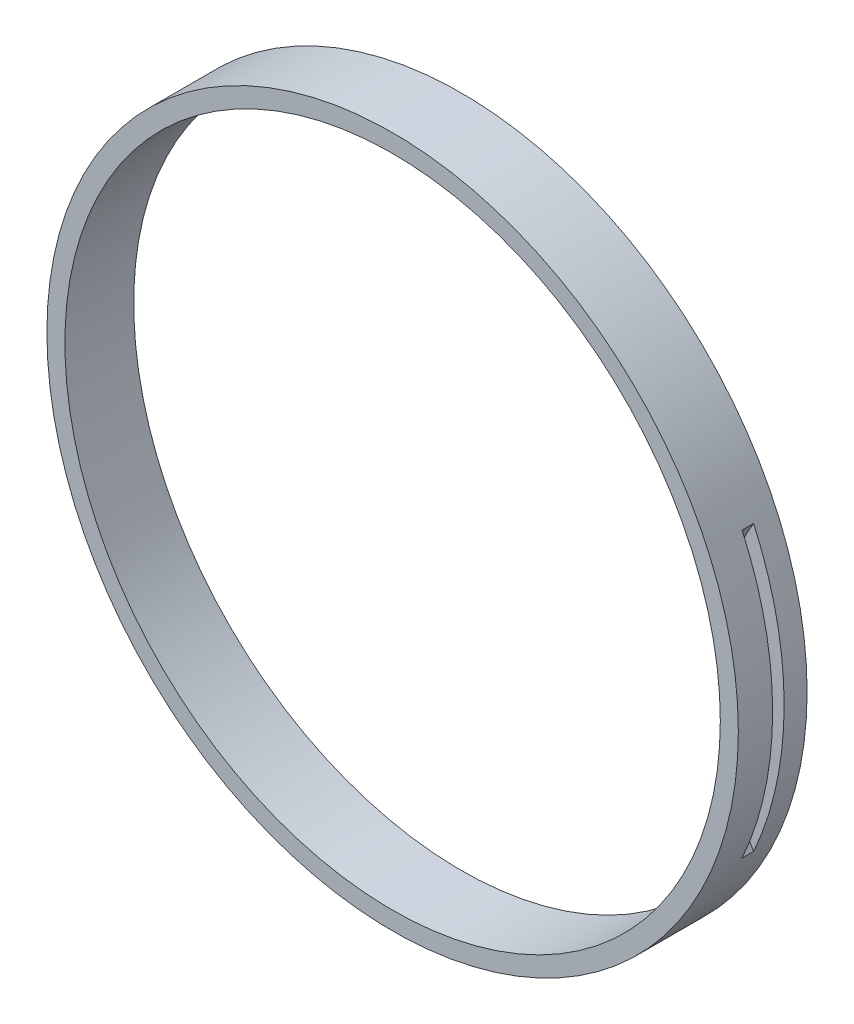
ISO-10303-21;
HEADER;
FILE_DESCRIPTION(('STEP AP214'),'2;1');
FILE_NAME('part.step','',(''),(''),'','','');
FILE_SCHEMA(('AUTOMOTIVE_DESIGN { 1 0 10303 214 1 1 1 1 }'));
ENDSEC;
DATA;
#1=APPLICATION_CONTEXT('core data for automotive mechanical design processes');
#2=APPLICATION_PROTOCOL_DEFINITION('international standard','automotive_design',2000,#1);
#3=PRODUCT_CONTEXT('',#1,'mechanical');
#4=PRODUCT('Part','Part','',(#3));
#5=PRODUCT_RELATED_PRODUCT_CATEGORY('part','',(#4));
#6=PRODUCT_DEFINITION_FORMATION('','',#4);
#7=PRODUCT_DEFINITION_CONTEXT('part definition',#1,'design');
#8=PRODUCT_DEFINITION('design','',#6,#7);
#9=PRODUCT_DEFINITION_SHAPE('','',#8);
#10=(LENGTH_UNIT() NAMED_UNIT(*) SI_UNIT(.MILLI.,.METRE.));
#11=(NAMED_UNIT(*) PLANE_ANGLE_UNIT() SI_UNIT($,.RADIAN.));
#12=(NAMED_UNIT(*) SI_UNIT($,.STERADIAN.) SOLID_ANGLE_UNIT());
#13=UNCERTAINTY_MEASURE_WITH_UNIT(LENGTH_MEASURE(1.E-05),#10,'distance_accuracy_value','');
#14=(GEOMETRIC_REPRESENTATION_CONTEXT(3) GLOBAL_UNCERTAINTY_ASSIGNED_CONTEXT((#13)) GLOBAL_UNIT_ASSIGNED_CONTEXT((#10,
#11,#12)) REPRESENTATION_CONTEXT('',''));
#15=CARTESIAN_POINT('',(0.,0.,0.));
#16=DIRECTION('',(0.,0.,1.));
#17=DIRECTION('',(1.,0.,0.));
#18=AXIS2_PLACEMENT_3D('',#15,#16,#17);
#19=CARTESIAN_POINT('',(0.,0.,4.7498));
#20=DIRECTION('',(0.,0.,-1.));
#21=DIRECTION('',(-1.,0.,0.));
#22=AXIS2_PLACEMENT_3D('',#19,#20,#21);
#23=CYLINDRICAL_SURFACE('',#22,23.876);
#24=CARTESIAN_POINT('',(0.,0.,0.));
#25=DIRECTION('',(0.,0.,1.));
#26=DIRECTION('',(1.,0.,0.));
#27=AXIS2_PLACEMENT_3D('',#24,#25,#26);
#28=CIRCLE('',#27,23.876);
#29=CARTESIAN_POINT('',(23.876,0.,0.));
#30=VERTEX_POINT('',#29);
#31=EDGE_CURVE('E102',#30,#30,#28,.T.);
#32=ORIENTED_EDGE('',*,*,#31,.T.);
#33=EDGE_LOOP('',(#32));
#34=FACE_BOUND('',#33,.T.);
#35=CARTESIAN_POINT('',(0.,0.,4.7498));
#36=DIRECTION('',(0.,0.,1.));
#37=DIRECTION('',(1.,0.,0.));
#38=AXIS2_PLACEMENT_3D('',#35,#36,#37);
#39=CIRCLE('',#38,23.876);
#40=CARTESIAN_POINT('',(23.876,0.,4.7498));
#41=VERTEX_POINT('',#40);
#42=EDGE_CURVE('E105',#41,#41,#39,.T.);
#43=ORIENTED_EDGE('',*,*,#42,.F.);
#44=EDGE_LOOP('',(#43));
#45=FACE_BOUND('',#44,.T.);
#46=CARTESIAN_POINT('',(0.,0.,2.38125));
#47=DIRECTION('',(0.,0.,-1.));
#48=DIRECTION('',(-1.,0.,0.));
#49=AXIS2_PLACEMENT_3D('',#46,#47,#48);
#50=CIRCLE('',#49,23.876);
#51=CARTESIAN_POINT('',(21.7686466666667,9.80761940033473,2.38125));
#52=VERTEX_POINT('',#51);
#53=CARTESIAN_POINT('',(21.7686466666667,-9.80761940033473,2.38125));
#54=VERTEX_POINT('',#53);
#55=EDGE_CURVE('E79',#52,#54,#50,.T.);
#56=ORIENTED_EDGE('',*,*,#55,.F.);
#57=DIRECTION('',(0.,0.,-1.));
#58=VECTOR('',#57,1.);
#59=CARTESIAN_POINT('',(21.7686466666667,9.80761940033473,1.984375));
#60=LINE('',#59,#58);
#61=CARTESIAN_POINT('',(21.7686466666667,9.80761940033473,1.5875));
#62=VERTEX_POINT('',#61);
#63=EDGE_CURVE('E85',#52,#62,#60,.T.);
#64=ORIENTED_EDGE('',*,*,#63,.T.);
#65=CARTESIAN_POINT('',(0.,0.,1.5875));
#66=DIRECTION('',(0.,0.,-1.));
#67=DIRECTION('',(-1.,0.,0.));
#68=AXIS2_PLACEMENT_3D('',#65,#66,#67);
#69=CIRCLE('',#68,23.876);
#70=CARTESIAN_POINT('',(21.7686466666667,-9.80761940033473,1.5875));
#71=VERTEX_POINT('',#70);
#72=EDGE_CURVE('E74',#62,#71,#69,.T.);
#73=ORIENTED_EDGE('',*,*,#72,.T.);
#74=DIRECTION('',(0.,0.,-1.));
#75=VECTOR('',#74,1.);
#76=CARTESIAN_POINT('',(21.7686466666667,-9.80761940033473,1.984375));
#77=LINE('',#76,#75);
#78=EDGE_CURVE('E93',#71,#54,#77,.F.);
#79=ORIENTED_EDGE('',*,*,#78,.T.);
#80=EDGE_LOOP('',(#56,#64,#73,#79));
#81=FACE_BOUND('',#80,.T.);
#82=ADVANCED_FACE('F37',(#34,#45,#81),#23,.T.);
#83=CARTESIAN_POINT('',(0.,0.,4.7498));
#84=DIRECTION('',(0.,0.,-1.));
#85=DIRECTION('',(-1.,0.,0.));
#86=AXIS2_PLACEMENT_3D('',#83,#84,#85);
#87=CYLINDRICAL_SURFACE('',#86,22.6314);
#88=CARTESIAN_POINT('',(0.,0.,0.));
#89=DIRECTION('',(0.,0.,1.));
#90=DIRECTION('',(1.,0.,0.));
#91=AXIS2_PLACEMENT_3D('',#88,#89,#90);
#92=CIRCLE('',#91,22.6314);
#93=CARTESIAN_POINT('',(22.6314,0.,0.));
#94=VERTEX_POINT('',#93);
#95=EDGE_CURVE('E95',#94,#94,#92,.T.);
#96=ORIENTED_EDGE('',*,*,#95,.F.);
#97=EDGE_LOOP('',(#96));
#98=FACE_BOUND('',#97,.T.);
#99=CARTESIAN_POINT('',(0.,0.,4.7498));
#100=DIRECTION('',(0.,0.,1.));
#101=DIRECTION('',(1.,0.,0.));
#102=AXIS2_PLACEMENT_3D('',#99,#100,#101);
#103=CIRCLE('',#102,22.6314);
#104=CARTESIAN_POINT('',(22.6314,0.,4.7498));
#105=VERTEX_POINT('',#104);
#106=EDGE_CURVE('E99',#105,#105,#103,.T.);
#107=ORIENTED_EDGE('',*,*,#106,.T.);
#108=EDGE_LOOP('',(#107));
#109=FACE_BOUND('',#108,.T.);
#110=DIRECTION('',(0.,0.,-1.));
#111=VECTOR('',#110,1.);
#112=CARTESIAN_POINT('',(21.0090258,8.41433900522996,1.984375));
#113=LINE('',#112,#111);
#114=CARTESIAN_POINT('',(21.0090258,8.41433900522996,2.38125));
#115=VERTEX_POINT('',#114);
#116=CARTESIAN_POINT('',(21.0090258,8.41433900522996,1.5875));
#117=VERTEX_POINT('',#116);
#118=EDGE_CURVE('E88',#115,#117,#113,.T.);
#119=ORIENTED_EDGE('',*,*,#118,.F.);
#120=CARTESIAN_POINT('',(0.,0.,2.38125));
#121=DIRECTION('',(0.,0.,-1.));
#122=DIRECTION('',(-1.,0.,0.));
#123=AXIS2_PLACEMENT_3D('',#120,#121,#122);
#124=CIRCLE('',#123,22.6314);
#125=CARTESIAN_POINT('',(21.0090258,-8.41433900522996,2.38125));
#126=VERTEX_POINT('',#125);
#127=EDGE_CURVE('E11',#115,#126,#124,.T.);
#128=ORIENTED_EDGE('',*,*,#127,.T.);
#129=DIRECTION('',(0.,0.,-1.));
#130=VECTOR('',#129,1.);
#131=CARTESIAN_POINT('',(21.0090258,-8.41433900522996,1.984375));
#132=LINE('',#131,#130);
#133=CARTESIAN_POINT('',(21.0090258,-8.41433900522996,1.5875));
#134=VERTEX_POINT('',#133);
#135=EDGE_CURVE('E44',#134,#126,#132,.F.);
#136=ORIENTED_EDGE('',*,*,#135,.F.);
#137=CARTESIAN_POINT('',(0.,0.,1.5875));
#138=DIRECTION('',(0.,0.,-1.));
#139=DIRECTION('',(-1.,0.,0.));
#140=AXIS2_PLACEMENT_3D('',#137,#138,#139);
#141=CIRCLE('',#140,22.6314);
#142=EDGE_CURVE('E108',#117,#134,#141,.T.);
#143=ORIENTED_EDGE('',*,*,#142,.F.);
#144=EDGE_LOOP('',(#119,#128,#136,#143));
#145=FACE_BOUND('',#144,.T.);
#146=ADVANCED_FACE('F121',(#98,#109,#145),#87,.F.);
#147=CARTESIAN_POINT('',(0.,0.,4.7498));
#148=DIRECTION('',(0.,0.,1.));
#149=DIRECTION('',(1.,0.,0.));
#150=AXIS2_PLACEMENT_3D('',#147,#148,#149);
#151=PLANE('',#150);
#152=ORIENTED_EDGE('',*,*,#42,.T.);
#153=EDGE_LOOP('',(#152));
#154=FACE_BOUND('',#153,.T.);
#155=ORIENTED_EDGE('',*,*,#106,.F.);
#156=EDGE_LOOP('',(#155));
#157=FACE_BOUND('',#156,.T.);
#158=ADVANCED_FACE('F123',(#154,#157),#151,.T.);
#159=CARTESIAN_POINT('',(0.,0.,0.));
#160=DIRECTION('',(0.,0.,1.));
#161=DIRECTION('',(1.,0.,0.));
#162=AXIS2_PLACEMENT_3D('',#159,#160,#161);
#163=PLANE('',#162);
#164=ORIENTED_EDGE('',*,*,#31,.F.);
#165=EDGE_LOOP('',(#164));
#166=FACE_BOUND('',#165,.T.);
#167=ORIENTED_EDGE('',*,*,#95,.T.);
#168=EDGE_LOOP('',(#167));
#169=FACE_BOUND('',#168,.T.);
#170=ADVANCED_FACE('F130',(#166,#169),#163,.F.);
#171=CARTESIAN_POINT('',(38.1,0.,2.38125));
#172=DIRECTION('',(0.,0.,-1.));
#173=DIRECTION('',(-1.,0.,0.));
#174=AXIS2_PLACEMENT_3D('',#171,#172,#173);
#175=CYLINDRICAL_SURFACE('',#174,19.05);
#176=CARTESIAN_POINT('',(38.1,0.,1.5875));
#177=DIRECTION('',(0.,0.,-1.));
#178=DIRECTION('',(-1.,0.,0.));
#179=AXIS2_PLACEMENT_3D('',#176,#177,#178);
#180=CIRCLE('',#179,19.05);
#181=EDGE_CURVE('E51',#71,#134,#180,.T.);
#182=ORIENTED_EDGE('',*,*,#181,.T.);
#183=ORIENTED_EDGE('',*,*,#135,.T.);
#184=CARTESIAN_POINT('',(38.1,0.,2.38125));
#185=DIRECTION('',(0.,0.,-1.));
#186=DIRECTION('',(-1.,0.,0.));
#187=AXIS2_PLACEMENT_3D('',#184,#185,#186);
#188=CIRCLE('',#187,19.05);
#189=EDGE_CURVE('E90',#54,#126,#188,.T.);
#190=ORIENTED_EDGE('',*,*,#189,.F.);
#191=ORIENTED_EDGE('',*,*,#78,.F.);
#192=EDGE_LOOP('',(#182,#183,#190,#191));
#193=FACE_BOUND('',#192,.T.);
#194=ADVANCED_FACE('F116',(#193),#175,.F.);
#195=EDGE_CURVE('E80',#115,#52,#188,.T.);
#196=ORIENTED_EDGE('',*,*,#195,.F.);
#197=ORIENTED_EDGE('',*,*,#118,.T.);
#198=EDGE_CURVE('E56',#117,#62,#180,.T.);
#199=ORIENTED_EDGE('',*,*,#198,.T.);
#200=ORIENTED_EDGE('',*,*,#63,.F.);
#201=EDGE_LOOP('',(#196,#197,#199,#200));
#202=FACE_BOUND('',#201,.T.);
#203=ADVANCED_FACE('F84',(#202),#175,.F.);
#204=CARTESIAN_POINT('',(38.1,0.,2.38125));
#205=DIRECTION('',(0.,0.,-1.));
#206=DIRECTION('',(-1.,0.,0.));
#207=AXIS2_PLACEMENT_3D('',#204,#205,#206);
#208=PLANE('',#207);
#209=ORIENTED_EDGE('',*,*,#55,.T.);
#210=ORIENTED_EDGE('',*,*,#189,.T.);
#211=ORIENTED_EDGE('',*,*,#127,.F.);
#212=ORIENTED_EDGE('',*,*,#195,.T.);
#213=EDGE_LOOP('',(#209,#210,#211,#212));
#214=FACE_BOUND('',#213,.T.);
#215=ADVANCED_FACE('F119',(#214),#208,.T.);
#216=CARTESIAN_POINT('',(38.1,0.,1.5875));
#217=DIRECTION('',(0.,0.,-1.));
#218=DIRECTION('',(-1.,0.,0.));
#219=AXIS2_PLACEMENT_3D('',#216,#217,#218);
#220=PLANE('',#219);
#221=ORIENTED_EDGE('',*,*,#198,.F.);
#222=ORIENTED_EDGE('',*,*,#142,.T.);
#223=ORIENTED_EDGE('',*,*,#181,.F.);
#224=ORIENTED_EDGE('',*,*,#72,.F.);
#225=EDGE_LOOP('',(#221,#222,#223,#224));
#226=FACE_BOUND('',#225,.T.);
#227=ADVANCED_FACE('F75',(#226),#220,.F.);
#228=CLOSED_SHELL('',(#82,#146,#158,#170,#194,#203,#215,#227));
#229=MANIFOLD_SOLID_BREP('B2',#228);
#230=ADVANCED_BREP_SHAPE_REPRESENTATION('',(#18,#229),#14);
#231=SHAPE_DEFINITION_REPRESENTATION(#9,#230);
ENDSEC;
END-ISO-10303-21;
